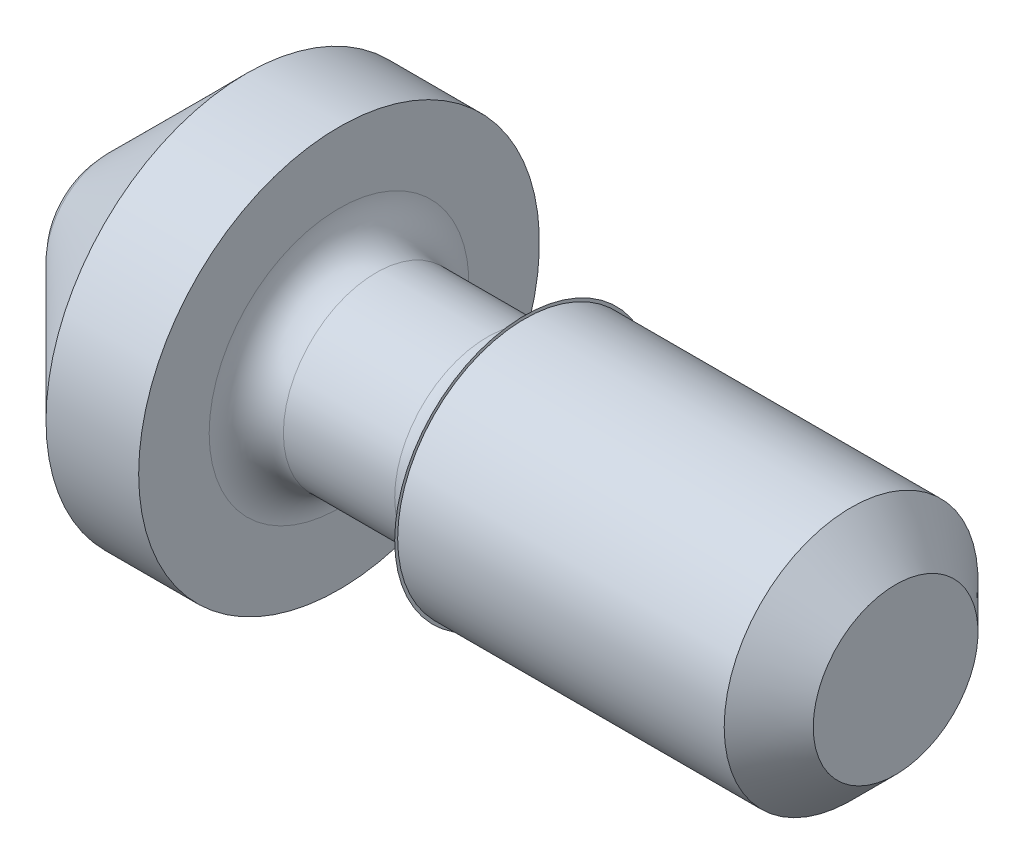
ISO-10303-21;
HEADER;
FILE_DESCRIPTION(('STEP AP214'),'2;1');
FILE_NAME('part.step','',(''),(''),'','','');
FILE_SCHEMA(('AUTOMOTIVE_DESIGN { 1 0 10303 214 1 1 1 1 }'));
ENDSEC;
DATA;
#1=APPLICATION_CONTEXT('core data for automotive mechanical design processes');
#2=APPLICATION_PROTOCOL_DEFINITION('international standard','automotive_design',2000,#1);
#3=PRODUCT_CONTEXT('',#1,'mechanical');
#4=PRODUCT('Part','Part','',(#3));
#5=PRODUCT_RELATED_PRODUCT_CATEGORY('part','',(#4));
#6=PRODUCT_DEFINITION_FORMATION('','',#4);
#7=PRODUCT_DEFINITION_CONTEXT('part definition',#1,'design');
#8=PRODUCT_DEFINITION('design','',#6,#7);
#9=PRODUCT_DEFINITION_SHAPE('','',#8);
#10=(LENGTH_UNIT() NAMED_UNIT(*) SI_UNIT(.MILLI.,.METRE.));
#11=(NAMED_UNIT(*) PLANE_ANGLE_UNIT() SI_UNIT($,.RADIAN.));
#12=(NAMED_UNIT(*) SI_UNIT($,.STERADIAN.) SOLID_ANGLE_UNIT());
#13=UNCERTAINTY_MEASURE_WITH_UNIT(LENGTH_MEASURE(1.E-05),#10,'distance_accuracy_value','');
#14=(GEOMETRIC_REPRESENTATION_CONTEXT(3) GLOBAL_UNCERTAINTY_ASSIGNED_CONTEXT((#13)) GLOBAL_UNIT_ASSIGNED_CONTEXT((#10,
#11,#12)) REPRESENTATION_CONTEXT('',''));
#15=CARTESIAN_POINT('',(0.,0.,0.));
#16=DIRECTION('',(0.,0.,1.));
#17=DIRECTION('',(1.,0.,0.));
#18=AXIS2_PLACEMENT_3D('',#15,#16,#17);
#19=CARTESIAN_POINT('',(-6.35,0.,0.));
#20=DIRECTION('',(-1.,0.,0.));
#21=DIRECTION('',(0.,0.,1.));
#22=AXIS2_PLACEMENT_3D('',#19,#20,#21);
#23=PLANE('',#22);
#24=CARTESIAN_POINT('',(-6.35,-2.1717,0.));
#25=DIRECTION('',(-1.,0.,0.));
#26=DIRECTION('',(0.,0.,1.));
#27=AXIS2_PLACEMENT_3D('',#24,#25,#26);
#28=CIRCLE('',#27,2.2225);
#29=CARTESIAN_POINT('',(-6.35,-2.1717,2.2225));
#30=VERTEX_POINT('',#29);
#31=EDGE_CURVE('E65',#30,#30,#28,.T.);
#32=ORIENTED_EDGE('',*,*,#31,.F.);
#33=EDGE_LOOP('',(#32));
#34=FACE_BOUND('',#33,.T.);
#35=CARTESIAN_POINT('',(-6.35,-2.1717,0.));
#36=DIRECTION('',(-1.,0.,0.));
#37=DIRECTION('',(0.,0.,1.));
#38=AXIS2_PLACEMENT_3D('',#35,#36,#37);
#39=CIRCLE('',#38,2.1717);
#40=CARTESIAN_POINT('',(-6.35,-2.1717,2.1717));
#41=VERTEX_POINT('',#40);
#42=EDGE_CURVE('E10',#41,#41,#39,.T.);
#43=ORIENTED_EDGE('',*,*,#42,.T.);
#44=EDGE_LOOP('',(#43));
#45=FACE_BOUND('',#44,.T.);
#46=ADVANCED_FACE('F31',(#34,#45),#23,.F.);
#47=CARTESIAN_POINT('',(-46.6278687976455,-2.1717,0.));
#48=DIRECTION('',(-1.,0.,0.));
#49=DIRECTION('',(0.,0.,1.));
#50=AXIS2_PLACEMENT_3D('',#47,#48,#49);
#51=CYLINDRICAL_SURFACE('',#50,2.1717);
#52=ORIENTED_EDGE('',*,*,#42,.F.);
#53=EDGE_LOOP('',(#52));
#54=FACE_BOUND('',#53,.T.);
#55=CARTESIAN_POINT('',(-0.761999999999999,-2.1717,0.));
#56=DIRECTION('',(-1.,0.,0.));
#57=DIRECTION('',(0.,0.,1.));
#58=AXIS2_PLACEMENT_3D('',#55,#56,#57);
#59=CIRCLE('',#58,2.1717);
#60=CARTESIAN_POINT('',(-0.761999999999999,-2.1717,2.1717));
#61=VERTEX_POINT('',#60);
#62=EDGE_CURVE('E37',#61,#61,#59,.T.);
#63=ORIENTED_EDGE('',*,*,#62,.T.);
#64=EDGE_LOOP('',(#63));
#65=FACE_BOUND('',#64,.T.);
#66=ADVANCED_FACE('F72',(#54,#65),#51,.T.);
#67=CARTESIAN_POINT('',(0.,-2.1717,0.));
#68=DIRECTION('',(-1.,0.,0.));
#69=DIRECTION('',(0.,0.,1.));
#70=AXIS2_PLACEMENT_3D('',#67,#68,#69);
#71=CONICAL_SURFACE('',#70,1.4097,0.785398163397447);
#72=ORIENTED_EDGE('',*,*,#62,.F.);
#73=EDGE_LOOP('',(#72));
#74=FACE_BOUND('',#73,.T.);
#75=CARTESIAN_POINT('',(0.,-2.1717,0.));
#76=DIRECTION('',(-1.,0.,0.));
#77=DIRECTION('',(0.,0.,1.));
#78=AXIS2_PLACEMENT_3D('',#75,#76,#77);
#79=CIRCLE('',#78,1.4097);
#80=CARTESIAN_POINT('',(0.,-2.1717,1.4097));
#81=VERTEX_POINT('',#80);
#82=EDGE_CURVE('E41',#81,#81,#79,.T.);
#83=ORIENTED_EDGE('',*,*,#82,.T.);
#84=EDGE_LOOP('',(#83));
#85=FACE_BOUND('',#84,.T.);
#86=ADVANCED_FACE('F76',(#74,#85),#71,.T.);
#87=CARTESIAN_POINT('',(0.,-0.761999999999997,0.));
#88=DIRECTION('',(-1.,0.,0.));
#89=DIRECTION('',(0.,0.,1.));
#90=AXIS2_PLACEMENT_3D('',#87,#88,#89);
#91=PLANE('',#90);
#92=ORIENTED_EDGE('',*,*,#82,.F.);
#93=EDGE_LOOP('',(#92));
#94=FACE_BOUND('',#93,.T.);
#95=ADVANCED_FACE('F81',(#94),#91,.F.);
#96=CARTESIAN_POINT('',(-12.3843692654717,-2.1717,0.));
#97=DIRECTION('',(-1.,0.,0.));
#98=DIRECTION('',(0.,1.,0.));
#99=AXIS2_PLACEMENT_3D('',#96,#97,#98);
#100=SPHERICAL_SURFACE('',#99,1.524);
#101=CARTESIAN_POINT('',(-13.462,-2.1717,0.));
#102=DIRECTION('',(-1.,0.,0.));
#103=DIRECTION('',(0.,0.,1.));
#104=AXIS2_PLACEMENT_3D('',#101,#102,#103);
#105=CIRCLE('',#104,1.07763073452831);
#106=CARTESIAN_POINT('',(-13.462,-2.1717,-1.07763073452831));
#107=VERTEX_POINT('',#106);
#108=EDGE_CURVE('E45',#107,#107,#105,.T.);
#109=ORIENTED_EDGE('',*,*,#108,.T.);
#110=EDGE_LOOP('',(#109));
#111=FACE_BOUND('',#110,.T.);
#112=ADVANCED_FACE('F87',(#111),#100,.T.);
#113=CARTESIAN_POINT('',(-11.1106307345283,-2.1717,0.));
#114=DIRECTION('',(1.,0.,0.));
#115=DIRECTION('',(0.,0.,-1.));
#116=AXIS2_PLACEMENT_3D('',#113,#114,#115);
#117=CONICAL_SURFACE('',#116,3.429,0.785398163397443);
#118=CARTESIAN_POINT('',(-11.1106307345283,-2.1717,0.));
#119=DIRECTION('',(-1.,0.,0.));
#120=DIRECTION('',(0.,0.,1.));
#121=AXIS2_PLACEMENT_3D('',#118,#119,#120);
#122=CIRCLE('',#121,3.429);
#123=CARTESIAN_POINT('',(-11.1106307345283,-2.1717,-3.429));
#124=VERTEX_POINT('',#123);
#125=EDGE_CURVE('E50',#124,#124,#122,.T.);
#126=CARTESIAN_POINT('',(-13.462,-2.1717,-1.07763073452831));
#127=CARTESIAN_POINT('',(-13.4375065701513,-2.1717,-1.10212416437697));
#128=CARTESIAN_POINT('',(-13.4130131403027,-2.1717,-1.12661759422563));
#129=CARTESIAN_POINT('',(-13.3640262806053,-2.1717,-1.17560445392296));
#130=CARTESIAN_POINT('',(-13.3395328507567,-2.1717,-1.20009788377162));
#131=CARTESIAN_POINT('',(-13.2905459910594,-2.1717,-1.24908474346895));
#132=CARTESIAN_POINT('',(-13.2660525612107,-2.1717,-1.27357817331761));
#133=CARTESIAN_POINT('',(-13.2170657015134,-2.1717,-1.32256503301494));
#134=CARTESIAN_POINT('',(-13.1925722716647,-2.1717,-1.34705846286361));
#135=CARTESIAN_POINT('',(-13.1435854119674,-2.1717,-1.39604532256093));
#136=CARTESIAN_POINT('',(-13.1190919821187,-2.1717,-1.4205387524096));
#137=CARTESIAN_POINT('',(-13.0701051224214,-2.1717,-1.46952561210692));
#138=CARTESIAN_POINT('',(-13.0456116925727,-2.1717,-1.49401904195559));
#139=CARTESIAN_POINT('',(-12.9966248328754,-2.1717,-1.54300590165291));
#140=CARTESIAN_POINT('',(-12.9721314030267,-2.1717,-1.56749933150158));
#141=CARTESIAN_POINT('',(-12.9231445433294,-2.1717,-1.6164861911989));
#142=CARTESIAN_POINT('',(-12.8986511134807,-2.1717,-1.64097962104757));
#143=CARTESIAN_POINT('',(-12.8496642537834,-2.1717,-1.68996648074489));
#144=CARTESIAN_POINT('',(-12.8251708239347,-2.1717,-1.71445991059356));
#145=CARTESIAN_POINT('',(-12.7761839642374,-2.1717,-1.76344677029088));
#146=CARTESIAN_POINT('',(-12.7516905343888,-2.1717,-1.78794020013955));
#147=CARTESIAN_POINT('',(-12.7027036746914,-2.1717,-1.83692705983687));
#148=CARTESIAN_POINT('',(-12.6782102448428,-2.1717,-1.86142048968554));
#149=CARTESIAN_POINT('',(-12.6292233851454,-2.1717,-1.91040734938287));
#150=CARTESIAN_POINT('',(-12.6047299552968,-2.1717,-1.93490077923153));
#151=CARTESIAN_POINT('',(-12.5557430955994,-2.1717,-1.98388763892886));
#152=CARTESIAN_POINT('',(-12.5312496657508,-2.1717,-2.00838106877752));
#153=CARTESIAN_POINT('',(-12.4822628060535,-2.1717,-2.05736792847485));
#154=CARTESIAN_POINT('',(-12.4577693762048,-2.1717,-2.08186135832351));
#155=CARTESIAN_POINT('',(-12.4087825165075,-2.1717,-2.13084821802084));
#156=CARTESIAN_POINT('',(-12.3842890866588,-2.1717,-2.1553416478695));
#157=CARTESIAN_POINT('',(-12.3353022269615,-2.1717,-2.20432850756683));
#158=CARTESIAN_POINT('',(-12.3108087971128,-2.1717,-2.22882193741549));
#159=CARTESIAN_POINT('',(-12.2618219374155,-2.1717,-2.27780879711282));
#160=CARTESIAN_POINT('',(-12.2373285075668,-2.1717,-2.30230222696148));
#161=CARTESIAN_POINT('',(-12.1883416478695,-2.1717,-2.35128908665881));
#162=CARTESIAN_POINT('',(-12.1638482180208,-2.1717,-2.37578251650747));
#163=CARTESIAN_POINT('',(-12.1148613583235,-2.1717,-2.4247693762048));
#164=CARTESIAN_POINT('',(-12.0903679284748,-2.1717,-2.44926280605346));
#165=CARTESIAN_POINT('',(-12.0413810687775,-2.1717,-2.49824966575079));
#166=CARTESIAN_POINT('',(-12.0168876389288,-2.1717,-2.52274309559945));
#167=CARTESIAN_POINT('',(-11.9679007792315,-2.1717,-2.57172995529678));
#168=CARTESIAN_POINT('',(-11.9434073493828,-2.1717,-2.59622338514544));
#169=CARTESIAN_POINT('',(-11.8944204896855,-2.1717,-2.64521024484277));
#170=CARTESIAN_POINT('',(-11.8699270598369,-2.1717,-2.66970367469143));
#171=CARTESIAN_POINT('',(-11.8209402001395,-2.1717,-2.71869053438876));
#172=CARTESIAN_POINT('',(-11.7964467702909,-2.1717,-2.74318396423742));
#173=CARTESIAN_POINT('',(-11.7474599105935,-2.1717,-2.79217082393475));
#174=CARTESIAN_POINT('',(-11.7229664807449,-2.1717,-2.81666425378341));
#175=CARTESIAN_POINT('',(-11.6739796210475,-2.1717,-2.86565111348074));
#176=CARTESIAN_POINT('',(-11.6494861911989,-2.1717,-2.8901445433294));
#177=CARTESIAN_POINT('',(-11.6004993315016,-2.1717,-2.93913140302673));
#178=CARTESIAN_POINT('',(-11.5760059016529,-2.1717,-2.96362483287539));
#179=CARTESIAN_POINT('',(-11.5270190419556,-2.1717,-3.01261169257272));
#180=CARTESIAN_POINT('',(-11.5025256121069,-2.1717,-3.03710512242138));
#181=CARTESIAN_POINT('',(-11.4535387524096,-2.1717,-3.08609198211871));
#182=CARTESIAN_POINT('',(-11.4290453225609,-2.1717,-3.11058541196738));
#183=CARTESIAN_POINT('',(-11.3800584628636,-2.1717,-3.1595722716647));
#184=CARTESIAN_POINT('',(-11.3555650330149,-2.1717,-3.18406570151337));
#185=CARTESIAN_POINT('',(-11.3065781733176,-2.1717,-3.23305256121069));
#186=CARTESIAN_POINT('',(-11.2820847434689,-2.1717,-3.25754599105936));
#187=CARTESIAN_POINT('',(-11.2330978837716,-2.1717,-3.30653285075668));
#188=CARTESIAN_POINT('',(-11.2086044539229,-2.1717,-3.33102628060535));
#189=CARTESIAN_POINT('',(-11.1596175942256,-2.1717,-3.38001314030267));
#190=CARTESIAN_POINT('',(-11.1351241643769,-2.1717,-3.40450657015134));
#191=CARTESIAN_POINT('',(-11.1106307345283,-2.1717,-3.429));
#192=B_SPLINE_CURVE_WITH_KNOTS('',3,(#126,#127,#128,#129,#130,#131,#132,#133,#134,#135,#136,
#137,#138,#139,#140,#141,#142,#143,#144,#145,#146,#147,#148,#149,#150,#151,#152,#153,#154,#155,
#156,#157,#158,#159,#160,#161,#162,#163,#164,#165,#166,#167,#168,#169,#170,#171,#172,#173,#174,
#175,#176,#177,#178,#179,#180,#181,#182,#183,#184,#185,#186,#187,#188,#189,#190,#191),
.UNSPECIFIED.,.F.,.F.,(4,2,2,2,2,2,2,2,2,2,2,2,2,2,2,2,2,2,2,2,2,2,2,2,2,2,2,2,2,2,2,2,4),(0.,
0.103916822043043,0.207833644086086,0.311750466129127,0.415667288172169,0.519584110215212,
0.623500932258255,0.727417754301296,0.831334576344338,0.935251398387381,1.03916822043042,
1.14308504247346,1.24700186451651,1.35091868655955,1.45483550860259,1.55875233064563,
1.66266915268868,1.76658597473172,1.87050279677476,1.9744196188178,2.07833644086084,
2.18225326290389,2.28617008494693,2.39008690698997,2.49400372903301,2.59792055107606,
2.7018373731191,2.80575419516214,2.90967101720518,3.01358783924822,3.11750466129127,
3.22142148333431,3.32533830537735),.UNSPECIFIED.);
#193=EDGE_CURVE('BSEAM91',#107,#124,#192,.T.);
#194=ORIENTED_EDGE('',*,*,#108,.F.);
#195=ORIENTED_EDGE('',*,*,#125,.T.);
#196=ORIENTED_EDGE('',*,*,#193,.T.);
#197=ORIENTED_EDGE('',*,*,#193,.F.);
#198=EDGE_LOOP('',(#194,#196,#195,#197));
#199=FACE_BOUND('',#198,.T.);
#200=ADVANCED_FACE('F91',(#199),#117,.T.);
#201=CARTESIAN_POINT('',(-46.6278687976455,-2.1717,0.));
#202=DIRECTION('',(-1.,0.,0.));
#203=DIRECTION('',(0.,0.,1.));
#204=AXIS2_PLACEMENT_3D('',#201,#202,#203);
#205=CYLINDRICAL_SURFACE('',#204,3.429);
#206=ORIENTED_EDGE('',*,*,#125,.F.);
#207=EDGE_LOOP('',(#206));
#208=FACE_BOUND('',#207,.T.);
#209=CARTESIAN_POINT('',(-9.525,-2.1717,0.));
#210=DIRECTION('',(-1.,0.,0.));
#211=DIRECTION('',(0.,0.,1.));
#212=AXIS2_PLACEMENT_3D('',#209,#210,#211);
#213=CIRCLE('',#212,3.429);
#214=CARTESIAN_POINT('',(-9.525,-2.1717,3.429));
#215=VERTEX_POINT('',#214);
#216=EDGE_CURVE('E53',#215,#215,#213,.T.);
#217=ORIENTED_EDGE('',*,*,#216,.T.);
#218=EDGE_LOOP('',(#217));
#219=FACE_BOUND('',#218,.T.);
#220=ADVANCED_FACE('F95',(#208,#219),#205,.T.);
#221=CARTESIAN_POINT('',(-9.525,0.0508000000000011,0.));
#222=DIRECTION('',(-1.,0.,0.));
#223=DIRECTION('',(0.,0.,1.));
#224=AXIS2_PLACEMENT_3D('',#221,#222,#223);
#225=PLANE('',#224);
#226=ORIENTED_EDGE('',*,*,#216,.F.);
#227=EDGE_LOOP('',(#226));
#228=FACE_BOUND('',#227,.T.);
#229=CARTESIAN_POINT('',(-9.52500000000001,-2.1717,0.));
#230=DIRECTION('',(-1.,0.,0.));
#231=DIRECTION('',(0.,0.,1.));
#232=AXIS2_PLACEMENT_3D('',#229,#230,#231);
#233=CIRCLE('',#232,2.2225);
#234=CARTESIAN_POINT('',(-9.52500000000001,-2.1717,2.2225));
#235=VERTEX_POINT('',#234);
#236=EDGE_CURVE('E56',#235,#235,#233,.T.);
#237=ORIENTED_EDGE('',*,*,#236,.T.);
#238=EDGE_LOOP('',(#237));
#239=FACE_BOUND('',#238,.T.);
#240=ADVANCED_FACE('F99',(#228,#239),#225,.F.);
#241=CARTESIAN_POINT('',(-8.89,-2.1717,0.));
#242=DIRECTION('',(-1.,0.,0.));
#243=DIRECTION('',(0.,0.,1.));
#244=AXIS2_PLACEMENT_3D('',#241,#242,#243);
#245=TOROIDAL_SURFACE('',#244,2.2225,0.635000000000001);
#246=ORIENTED_EDGE('',*,*,#236,.F.);
#247=EDGE_LOOP('',(#246));
#248=FACE_BOUND('',#247,.T.);
#249=CARTESIAN_POINT('',(-8.89,-2.1717,0.));
#250=DIRECTION('',(-1.,0.,0.));
#251=DIRECTION('',(0.,0.,1.));
#252=AXIS2_PLACEMENT_3D('',#249,#250,#251);
#253=CIRCLE('',#252,1.5875);
#254=CARTESIAN_POINT('',(-8.89,-2.1717,1.5875));
#255=VERTEX_POINT('',#254);
#256=EDGE_CURVE('E59',#255,#255,#253,.T.);
#257=ORIENTED_EDGE('',*,*,#256,.T.);
#258=EDGE_LOOP('',(#257));
#259=FACE_BOUND('',#258,.T.);
#260=ADVANCED_FACE('F103',(#248,#259),#245,.F.);
#261=CARTESIAN_POINT('',(-46.6278687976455,-2.1717,0.));
#262=DIRECTION('',(-1.,0.,0.));
#263=DIRECTION('',(0.,0.,1.));
#264=AXIS2_PLACEMENT_3D('',#261,#262,#263);
#265=CYLINDRICAL_SURFACE('',#264,1.5875);
#266=ORIENTED_EDGE('',*,*,#256,.F.);
#267=EDGE_LOOP('',(#266));
#268=FACE_BOUND('',#267,.T.);
#269=CARTESIAN_POINT('',(-6.985,-2.1717,0.));
#270=DIRECTION('',(-1.,0.,0.));
#271=DIRECTION('',(0.,0.,1.));
#272=AXIS2_PLACEMENT_3D('',#269,#270,#271);
#273=CIRCLE('',#272,1.5875);
#274=CARTESIAN_POINT('',(-6.985,-2.1717,1.5875));
#275=VERTEX_POINT('',#274);
#276=EDGE_CURVE('E62',#275,#275,#273,.T.);
#277=ORIENTED_EDGE('',*,*,#276,.T.);
#278=EDGE_LOOP('',(#277));
#279=FACE_BOUND('',#278,.T.);
#280=ADVANCED_FACE('F107',(#268,#279),#265,.T.);
#281=CARTESIAN_POINT('',(-6.985,-2.1717,0.));
#282=DIRECTION('',(-1.,0.,0.));
#283=DIRECTION('',(0.,0.,1.));
#284=AXIS2_PLACEMENT_3D('',#281,#282,#283);
#285=TOROIDAL_SURFACE('',#284,2.2225,0.635);
#286=ORIENTED_EDGE('',*,*,#276,.F.);
#287=EDGE_LOOP('',(#286));
#288=FACE_BOUND('',#287,.T.);
#289=ORIENTED_EDGE('',*,*,#31,.T.);
#290=EDGE_LOOP('',(#289));
#291=FACE_BOUND('',#290,.T.);
#292=ADVANCED_FACE('F69',(#288,#291),#285,.F.);
#293=CLOSED_SHELL('',(#46,#66,#86,#95,#112,#200,#220,#240,#260,#280,#292));
#294=MANIFOLD_SOLID_BREP('B2',#293);
#295=ADVANCED_BREP_SHAPE_REPRESENTATION('',(#18,#294),#14);
#296=SHAPE_DEFINITION_REPRESENTATION(#9,#295);
ENDSEC;
END-ISO-10303-21;
